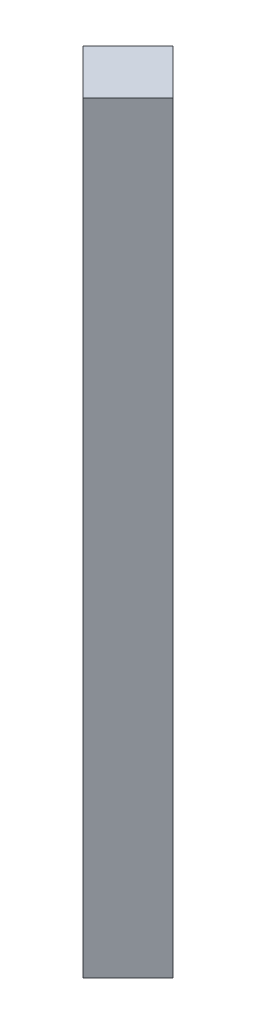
from build123d import *

# Parameters (mm, degrees)
BOSS_EXTRUDE1_DEPTH = 304.8


with BuildPart() as part:
    # Sketch2 → Boss-Extrude1 (new body)
    with BuildSketch(Plane(origin=(0, 0, 0), x_dir=(1, 0, 0), z_dir=(0, 1, 0))):
        Polygon((12.7, -5.260512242), (30.660512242, 12.7), (12.7, 30.660512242), (-5.260512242, 12.7), align=None)
    extrude(amount=BOSS_EXTRUDE1_DEPTH)


solid = part.part
